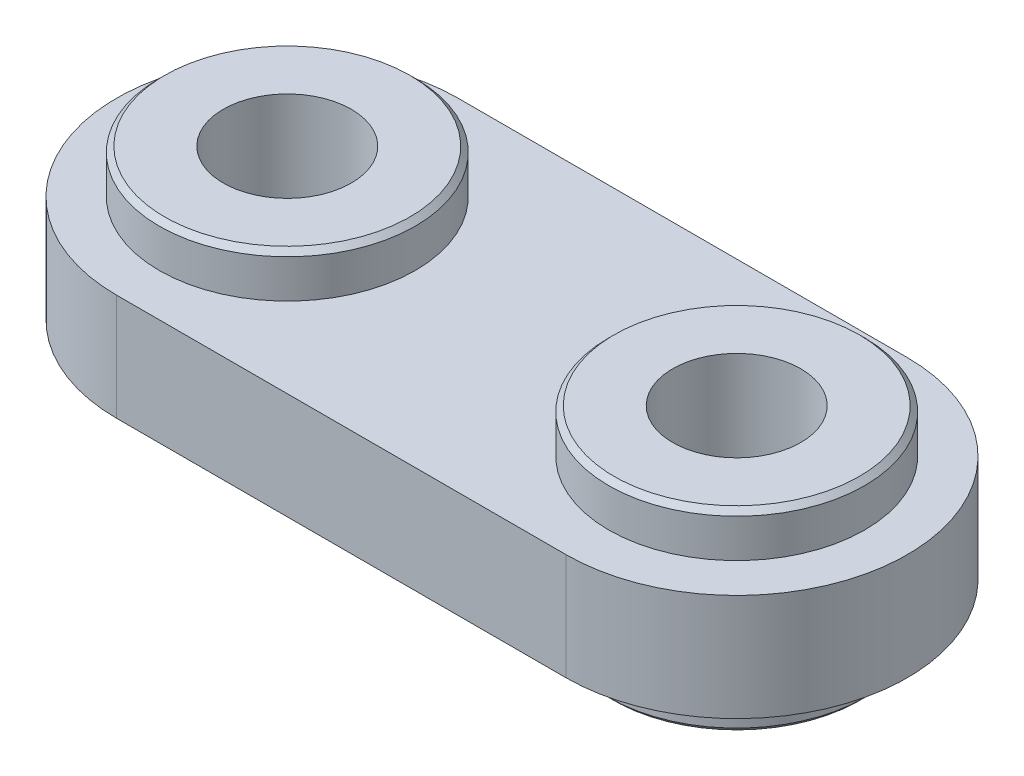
ISO-10303-21;
HEADER;
FILE_DESCRIPTION(('STEP AP214'),'2;1');
FILE_NAME('part.step','',(''),(''),'','','');
FILE_SCHEMA(('AUTOMOTIVE_DESIGN { 1 0 10303 214 1 1 1 1 }'));
ENDSEC;
DATA;
#1=APPLICATION_CONTEXT('core data for automotive mechanical design processes');
#2=APPLICATION_PROTOCOL_DEFINITION('international standard','automotive_design',2000,#1);
#3=PRODUCT_CONTEXT('',#1,'mechanical');
#4=PRODUCT('Part','Part','',(#3));
#5=PRODUCT_RELATED_PRODUCT_CATEGORY('part','',(#4));
#6=PRODUCT_DEFINITION_FORMATION('','',#4);
#7=PRODUCT_DEFINITION_CONTEXT('part definition',#1,'design');
#8=PRODUCT_DEFINITION('design','',#6,#7);
#9=PRODUCT_DEFINITION_SHAPE('','',#8);
#10=(LENGTH_UNIT() NAMED_UNIT(*) SI_UNIT(.MILLI.,.METRE.));
#11=(NAMED_UNIT(*) PLANE_ANGLE_UNIT() SI_UNIT($,.RADIAN.));
#12=(NAMED_UNIT(*) SI_UNIT($,.STERADIAN.) SOLID_ANGLE_UNIT());
#13=UNCERTAINTY_MEASURE_WITH_UNIT(LENGTH_MEASURE(1.E-05),#10,'distance_accuracy_value','');
#14=(GEOMETRIC_REPRESENTATION_CONTEXT(3) GLOBAL_UNCERTAINTY_ASSIGNED_CONTEXT((#13)) GLOBAL_UNIT_ASSIGNED_CONTEXT((#10,
#11,#12)) REPRESENTATION_CONTEXT('',''));
#15=CARTESIAN_POINT('',(0.,0.,0.));
#16=DIRECTION('',(0.,0.,1.));
#17=DIRECTION('',(1.,0.,0.));
#18=AXIS2_PLACEMENT_3D('',#15,#16,#17);
#19=CARTESIAN_POINT('',(0.,0.,0.));
#20=DIRECTION('',(0.,-1.,0.));
#21=DIRECTION('',(-1.,0.,0.));
#22=AXIS2_PLACEMENT_3D('',#19,#20,#21);
#23=CYLINDRICAL_SURFACE('',#22,8.);
#24=CARTESIAN_POINT('',(0.,-2.5,0.));
#25=DIRECTION('',(0.,1.,0.));
#26=DIRECTION('',(1.,0.,0.));
#27=AXIS2_PLACEMENT_3D('',#24,#25,#26);
#28=CIRCLE('',#27,8.);
#29=CARTESIAN_POINT('',(0.,-2.5,-8.));
#30=VERTEX_POINT('',#29);
#31=CARTESIAN_POINT('',(0.,-2.5,8.));
#32=VERTEX_POINT('',#31);
#33=EDGE_CURVE('E59',#30,#32,#28,.T.);
#34=ORIENTED_EDGE('',*,*,#33,.T.);
#35=DIRECTION('',(0.,-1.,0.));
#36=VECTOR('',#35,1.);
#37=CARTESIAN_POINT('',(0.,0.,8.));
#38=LINE('',#37,#36);
#39=CARTESIAN_POINT('',(0.,2.5,8.));
#40=VERTEX_POINT('',#39);
#41=EDGE_CURVE('E64',#40,#32,#38,.T.);
#42=ORIENTED_EDGE('',*,*,#41,.F.);
#43=CARTESIAN_POINT('',(0.,2.5,0.));
#44=DIRECTION('',(0.,1.,0.));
#45=DIRECTION('',(1.,0.,0.));
#46=AXIS2_PLACEMENT_3D('',#43,#44,#45);
#47=CIRCLE('',#46,8.);
#48=CARTESIAN_POINT('',(0.,2.5,-8.));
#49=VERTEX_POINT('',#48);
#50=EDGE_CURVE('E91',#49,#40,#47,.T.);
#51=ORIENTED_EDGE('',*,*,#50,.F.);
#52=DIRECTION('',(0.,-1.,0.));
#53=VECTOR('',#52,1.);
#54=CARTESIAN_POINT('',(0.,0.,-8.));
#55=LINE('',#54,#53);
#56=EDGE_CURVE('E66',#49,#30,#55,.T.);
#57=ORIENTED_EDGE('',*,*,#56,.T.);
#58=EDGE_LOOP('',(#34,#42,#51,#57));
#59=FACE_BOUND('',#58,.T.);
#60=ADVANCED_FACE('F14',(#59),#23,.T.);
#61=CARTESIAN_POINT('',(0.,0.,8.));
#62=DIRECTION('',(0.,0.,-1.));
#63=DIRECTION('',(0.,1.,0.));
#64=AXIS2_PLACEMENT_3D('',#61,#62,#63);
#65=PLANE('',#64);
#66=DIRECTION('',(1.,0.,0.));
#67=VECTOR('',#66,1.);
#68=CARTESIAN_POINT('',(0.,-2.5,8.));
#69=LINE('',#68,#67);
#70=CARTESIAN_POINT('',(21.068,-2.5,8.));
#71=VERTEX_POINT('',#70);
#72=EDGE_CURVE('E69',#32,#71,#69,.T.);
#73=ORIENTED_EDGE('',*,*,#72,.T.);
#74=DIRECTION('',(0.,-1.,0.));
#75=VECTOR('',#74,1.);
#76=CARTESIAN_POINT('',(21.068,0.,8.));
#77=LINE('',#76,#75);
#78=CARTESIAN_POINT('',(21.068,2.5,8.));
#79=VERTEX_POINT('',#78);
#80=EDGE_CURVE('E47',#79,#71,#77,.T.);
#81=ORIENTED_EDGE('',*,*,#80,.F.);
#82=DIRECTION('',(1.,0.,0.));
#83=VECTOR('',#82,1.);
#84=CARTESIAN_POINT('',(0.,2.5,8.));
#85=LINE('',#84,#83);
#86=EDGE_CURVE('E73',#40,#79,#85,.T.);
#87=ORIENTED_EDGE('',*,*,#86,.F.);
#88=ORIENTED_EDGE('',*,*,#41,.T.);
#89=EDGE_LOOP('',(#73,#81,#87,#88));
#90=FACE_BOUND('',#89,.T.);
#91=ADVANCED_FACE('F72',(#90),#65,.F.);
#92=CARTESIAN_POINT('',(21.068,0.,0.));
#93=DIRECTION('',(0.,-1.,0.));
#94=DIRECTION('',(-1.,0.,0.));
#95=AXIS2_PLACEMENT_3D('',#92,#93,#94);
#96=CYLINDRICAL_SURFACE('',#95,8.);
#97=CARTESIAN_POINT('',(21.068,-2.5,0.));
#98=DIRECTION('',(0.,1.,0.));
#99=DIRECTION('',(-1.,0.,0.));
#100=AXIS2_PLACEMENT_3D('',#97,#98,#99);
#101=CIRCLE('',#100,8.);
#102=CARTESIAN_POINT('',(21.068,-2.5,-8.));
#103=VERTEX_POINT('',#102);
#104=EDGE_CURVE('E31',#71,#103,#101,.T.);
#105=ORIENTED_EDGE('',*,*,#104,.T.);
#106=DIRECTION('',(0.,-1.,0.));
#107=VECTOR('',#106,1.);
#108=CARTESIAN_POINT('',(21.068,0.,-8.));
#109=LINE('',#108,#107);
#110=CARTESIAN_POINT('',(21.068,2.5,-8.));
#111=VERTEX_POINT('',#110);
#112=EDGE_CURVE('E51',#111,#103,#109,.T.);
#113=ORIENTED_EDGE('',*,*,#112,.F.);
#114=CARTESIAN_POINT('',(21.068,2.5,0.));
#115=DIRECTION('',(0.,1.,0.));
#116=DIRECTION('',(-1.,0.,0.));
#117=AXIS2_PLACEMENT_3D('',#114,#115,#116);
#118=CIRCLE('',#117,8.);
#119=EDGE_CURVE('E86',#79,#111,#118,.T.);
#120=ORIENTED_EDGE('',*,*,#119,.F.);
#121=ORIENTED_EDGE('',*,*,#80,.T.);
#122=EDGE_LOOP('',(#105,#113,#120,#121));
#123=FACE_BOUND('',#122,.T.);
#124=ADVANCED_FACE('F148',(#123),#96,.T.);
#125=CARTESIAN_POINT('',(21.068,0.,-8.));
#126=DIRECTION('',(0.,0.,1.));
#127=DIRECTION('',(0.,-1.,0.));
#128=AXIS2_PLACEMENT_3D('',#125,#126,#127);
#129=PLANE('',#128);
#130=DIRECTION('',(-1.,0.,0.));
#131=VECTOR('',#130,1.);
#132=CARTESIAN_POINT('',(21.068,-2.5,-8.));
#133=LINE('',#132,#131);
#134=EDGE_CURVE('E70',#103,#30,#133,.T.);
#135=ORIENTED_EDGE('',*,*,#134,.T.);
#136=ORIENTED_EDGE('',*,*,#56,.F.);
#137=DIRECTION('',(-1.,0.,0.));
#138=VECTOR('',#137,1.);
#139=CARTESIAN_POINT('',(21.068,2.5,-8.));
#140=LINE('',#139,#138);
#141=EDGE_CURVE('E93',#111,#49,#140,.T.);
#142=ORIENTED_EDGE('',*,*,#141,.F.);
#143=ORIENTED_EDGE('',*,*,#112,.T.);
#144=EDGE_LOOP('',(#135,#136,#142,#143));
#145=FACE_BOUND('',#144,.T.);
#146=ADVANCED_FACE('F152',(#145),#129,.F.);
#147=CARTESIAN_POINT('',(0.,-2.5,0.));
#148=DIRECTION('',(0.,1.,0.));
#149=DIRECTION('',(1.,0.,0.));
#150=AXIS2_PLACEMENT_3D('',#147,#148,#149);
#151=PLANE('',#150);
#152=CARTESIAN_POINT('',(21.0679999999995,-2.5,0.));
#153=DIRECTION('',(0.,1.,0.));
#154=DIRECTION('',(0.,0.,1.));
#155=AXIS2_PLACEMENT_3D('',#152,#153,#154);
#156=CIRCLE('',#155,6.);
#157=CARTESIAN_POINT('',(21.0679999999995,-2.5,6.00000000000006));
#158=VERTEX_POINT('',#157);
#159=EDGE_CURVE('E229',#158,#158,#156,.T.);
#160=ORIENTED_EDGE('',*,*,#159,.T.);
#161=EDGE_LOOP('',(#160));
#162=FACE_BOUND('',#161,.T.);
#163=CARTESIAN_POINT('',(0.,-2.5,0.));
#164=DIRECTION('',(0.,1.,0.));
#165=DIRECTION('',(0.,0.,1.));
#166=AXIS2_PLACEMENT_3D('',#163,#164,#165);
#167=CIRCLE('',#166,6.);
#168=CARTESIAN_POINT('',(0.,-2.5,6.));
#169=VERTEX_POINT('',#168);
#170=EDGE_CURVE('E102',#169,#169,#167,.T.);
#171=ORIENTED_EDGE('',*,*,#170,.T.);
#172=EDGE_LOOP('',(#171));
#173=FACE_BOUND('',#172,.T.);
#174=ORIENTED_EDGE('',*,*,#134,.F.);
#175=ORIENTED_EDGE('',*,*,#104,.F.);
#176=ORIENTED_EDGE('',*,*,#72,.F.);
#177=ORIENTED_EDGE('',*,*,#33,.F.);
#178=EDGE_LOOP('',(#174,#175,#176,#177));
#179=FACE_BOUND('',#178,.T.);
#180=ADVANCED_FACE('F75',(#162,#173,#179),#151,.F.);
#181=CARTESIAN_POINT('',(0.,2.5,0.));
#182=DIRECTION('',(0.,1.,0.));
#183=DIRECTION('',(1.,0.,0.));
#184=AXIS2_PLACEMENT_3D('',#181,#182,#183);
#185=PLANE('',#184);
#186=CARTESIAN_POINT('',(21.0679999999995,2.5,0.));
#187=DIRECTION('',(0.,1.,0.));
#188=DIRECTION('',(0.,0.,1.));
#189=AXIS2_PLACEMENT_3D('',#186,#187,#188);
#190=CIRCLE('',#189,6.);
#191=CARTESIAN_POINT('',(21.0679999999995,2.5,6.00000000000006));
#192=VERTEX_POINT('',#191);
#193=EDGE_CURVE('E105',#192,#192,#190,.T.);
#194=ORIENTED_EDGE('',*,*,#193,.F.);
#195=EDGE_LOOP('',(#194));
#196=FACE_BOUND('',#195,.T.);
#197=CARTESIAN_POINT('',(0.,2.5,0.));
#198=DIRECTION('',(0.,1.,0.));
#199=DIRECTION('',(0.,0.,1.));
#200=AXIS2_PLACEMENT_3D('',#197,#198,#199);
#201=CIRCLE('',#200,6.);
#202=CARTESIAN_POINT('',(0.,2.5,6.));
#203=VERTEX_POINT('',#202);
#204=EDGE_CURVE('E90',#203,#203,#201,.T.);
#205=ORIENTED_EDGE('',*,*,#204,.F.);
#206=EDGE_LOOP('',(#205));
#207=FACE_BOUND('',#206,.T.);
#208=ORIENTED_EDGE('',*,*,#141,.T.);
#209=ORIENTED_EDGE('',*,*,#50,.T.);
#210=ORIENTED_EDGE('',*,*,#86,.T.);
#211=ORIENTED_EDGE('',*,*,#119,.T.);
#212=EDGE_LOOP('',(#208,#209,#210,#211));
#213=FACE_BOUND('',#212,.T.);
#214=ADVANCED_FACE('F156',(#196,#207,#213),#185,.T.);
#215=CARTESIAN_POINT('',(0.,-4.6,0.));
#216=DIRECTION('',(0.,1.,0.));
#217=DIRECTION('',(-1.,0.,0.));
#218=AXIS2_PLACEMENT_3D('',#215,#216,#217);
#219=CYLINDRICAL_SURFACE('',#218,6.);
#220=CARTESIAN_POINT('',(0.,4.3,0.));
#221=DIRECTION('',(0.,-1.,0.));
#222=DIRECTION('',(0.,0.,-1.));
#223=AXIS2_PLACEMENT_3D('',#220,#221,#222);
#224=CIRCLE('',#223,6.);
#225=CARTESIAN_POINT('',(0.,4.3,-6.));
#226=VERTEX_POINT('',#225);
#227=EDGE_CURVE('E108',#226,#226,#224,.T.);
#228=ORIENTED_EDGE('',*,*,#227,.T.);
#229=EDGE_LOOP('',(#228));
#230=FACE_BOUND('',#229,.T.);
#231=ORIENTED_EDGE('',*,*,#204,.T.);
#232=EDGE_LOOP('',(#231));
#233=FACE_BOUND('',#232,.T.);
#234=ADVANCED_FACE('F159',(#230,#233),#219,.T.);
#235=CARTESIAN_POINT('',(0.,4.55,0.));
#236=DIRECTION('',(0.,-1.,0.));
#237=DIRECTION('',(0.,0.,-1.));
#238=AXIS2_PLACEMENT_3D('',#235,#236,#237);
#239=PLANE('',#238);
#240=CARTESIAN_POINT('',(0.,4.55,0.));
#241=DIRECTION('',(0.,-1.,0.));
#242=DIRECTION('',(0.,0.,-1.));
#243=AXIS2_PLACEMENT_3D('',#240,#241,#242);
#244=CIRCLE('',#243,5.75);
#245=CARTESIAN_POINT('',(0.,4.55,-5.75));
#246=VERTEX_POINT('',#245);
#247=EDGE_CURVE('E111',#246,#246,#244,.F.);
#248=ORIENTED_EDGE('',*,*,#247,.T.);
#249=EDGE_LOOP('',(#248));
#250=FACE_BOUND('',#249,.T.);
#251=CARTESIAN_POINT('',(0.,4.55,0.));
#252=DIRECTION('',(0.,-1.,0.));
#253=DIRECTION('',(0.,0.,-1.));
#254=AXIS2_PLACEMENT_3D('',#251,#252,#253);
#255=CIRCLE('',#254,3.);
#256=CARTESIAN_POINT('',(0.,4.55,-3.));
#257=VERTEX_POINT('',#256);
#258=EDGE_CURVE('E232',#257,#257,#255,.T.);
#259=ORIENTED_EDGE('',*,*,#258,.T.);
#260=EDGE_LOOP('',(#259));
#261=FACE_BOUND('',#260,.T.);
#262=ADVANCED_FACE('F163',(#250,#261),#239,.F.);
#263=CARTESIAN_POINT('',(0.,-4.6,0.));
#264=DIRECTION('',(0.,1.,0.));
#265=DIRECTION('',(-1.,0.,0.));
#266=AXIS2_PLACEMENT_3D('',#263,#264,#265);
#267=CYLINDRICAL_SURFACE('',#266,3.);
#268=CARTESIAN_POINT('',(0.,-4.55,0.));
#269=DIRECTION('',(0.,-1.,0.));
#270=DIRECTION('',(0.,0.,-1.));
#271=AXIS2_PLACEMENT_3D('',#268,#269,#270);
#272=CIRCLE('',#271,3.);
#273=CARTESIAN_POINT('',(0.,-4.55,-3.));
#274=VERTEX_POINT('',#273);
#275=EDGE_CURVE('E98',#274,#274,#272,.F.);
#276=ORIENTED_EDGE('',*,*,#275,.F.);
#277=EDGE_LOOP('',(#276));
#278=FACE_BOUND('',#277,.T.);
#279=ORIENTED_EDGE('',*,*,#258,.F.);
#280=EDGE_LOOP('',(#279));
#281=FACE_BOUND('',#280,.T.);
#282=ADVANCED_FACE('F165',(#278,#281),#267,.F.);
#283=CARTESIAN_POINT('',(0.,-4.55,0.));
#284=DIRECTION('',(0.,-1.,0.));
#285=DIRECTION('',(0.,0.,-1.));
#286=AXIS2_PLACEMENT_3D('',#283,#284,#285);
#287=PLANE('',#286);
#288=CARTESIAN_POINT('',(0.,-4.55,0.));
#289=DIRECTION('',(0.,-1.,0.));
#290=DIRECTION('',(0.,0.,-1.));
#291=AXIS2_PLACEMENT_3D('',#288,#289,#290);
#292=CIRCLE('',#291,5.75);
#293=CARTESIAN_POINT('',(0.,-4.55,-5.75));
#294=VERTEX_POINT('',#293);
#295=EDGE_CURVE('E23',#294,#294,#292,.T.);
#296=ORIENTED_EDGE('',*,*,#295,.T.);
#297=EDGE_LOOP('',(#296));
#298=FACE_BOUND('',#297,.T.);
#299=ORIENTED_EDGE('',*,*,#275,.T.);
#300=EDGE_LOOP('',(#299));
#301=FACE_BOUND('',#300,.T.);
#302=ADVANCED_FACE('F128',(#298,#301),#287,.T.);
#303=CARTESIAN_POINT('',(0.,-2.5,0.));
#304=DIRECTION('',(0.,-1.,0.));
#305=DIRECTION('',(1.,0.,0.));
#306=AXIS2_PLACEMENT_3D('',#303,#304,#305);
#307=CYLINDRICAL_SURFACE('',#306,6.);
#308=CARTESIAN_POINT('',(0.,-4.3,0.));
#309=DIRECTION('',(0.,-1.,0.));
#310=DIRECTION('',(0.,0.,-1.));
#311=AXIS2_PLACEMENT_3D('',#308,#309,#310);
#312=CIRCLE('',#311,6.);
#313=CARTESIAN_POINT('',(0.,-4.3,-6.));
#314=VERTEX_POINT('',#313);
#315=EDGE_CURVE('E9',#314,#314,#312,.F.);
#316=ORIENTED_EDGE('',*,*,#315,.T.);
#317=EDGE_LOOP('',(#316));
#318=FACE_BOUND('',#317,.T.);
#319=ORIENTED_EDGE('',*,*,#170,.F.);
#320=EDGE_LOOP('',(#319));
#321=FACE_BOUND('',#320,.T.);
#322=ADVANCED_FACE('F173',(#318,#321),#307,.T.);
#323=CARTESIAN_POINT('',(21.0679999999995,-4.6,0.));
#324=DIRECTION('',(0.,1.,0.));
#325=DIRECTION('',(-1.,0.,0.));
#326=AXIS2_PLACEMENT_3D('',#323,#324,#325);
#327=CYLINDRICAL_SURFACE('',#326,6.);
#328=CARTESIAN_POINT('',(21.0679999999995,4.3,0.));
#329=DIRECTION('',(0.,-1.,0.));
#330=DIRECTION('',(0.,0.,-1.));
#331=AXIS2_PLACEMENT_3D('',#328,#329,#330);
#332=CIRCLE('',#331,6.);
#333=CARTESIAN_POINT('',(21.0679999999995,4.3,-5.99999999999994));
#334=VERTEX_POINT('',#333);
#335=EDGE_CURVE('E114',#334,#334,#332,.T.);
#336=ORIENTED_EDGE('',*,*,#335,.T.);
#337=EDGE_LOOP('',(#336));
#338=FACE_BOUND('',#337,.T.);
#339=ORIENTED_EDGE('',*,*,#193,.T.);
#340=EDGE_LOOP('',(#339));
#341=FACE_BOUND('',#340,.T.);
#342=ADVANCED_FACE('F169',(#338,#341),#327,.T.);
#343=CARTESIAN_POINT('',(21.0679999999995,4.55,0.));
#344=DIRECTION('',(0.,-1.,0.));
#345=DIRECTION('',(0.,0.,-1.));
#346=AXIS2_PLACEMENT_3D('',#343,#344,#345);
#347=PLANE('',#346);
#348=CARTESIAN_POINT('',(21.0679999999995,4.55,0.));
#349=DIRECTION('',(0.,-1.,0.));
#350=DIRECTION('',(0.,0.,-1.));
#351=AXIS2_PLACEMENT_3D('',#348,#349,#350);
#352=CIRCLE('',#351,5.75);
#353=CARTESIAN_POINT('',(21.0679999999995,4.55,-5.74999999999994));
#354=VERTEX_POINT('',#353);
#355=EDGE_CURVE('E117',#354,#354,#352,.F.);
#356=ORIENTED_EDGE('',*,*,#355,.T.);
#357=EDGE_LOOP('',(#356));
#358=FACE_BOUND('',#357,.T.);
#359=CARTESIAN_POINT('',(21.0679999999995,4.55,0.));
#360=DIRECTION('',(0.,-1.,0.));
#361=DIRECTION('',(0.,0.,-1.));
#362=AXIS2_PLACEMENT_3D('',#359,#360,#361);
#363=CIRCLE('',#362,3.);
#364=CARTESIAN_POINT('',(21.0679999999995,4.55,-2.99999999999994));
#365=VERTEX_POINT('',#364);
#366=EDGE_CURVE('E227',#365,#365,#363,.T.);
#367=ORIENTED_EDGE('',*,*,#366,.T.);
#368=EDGE_LOOP('',(#367));
#369=FACE_BOUND('',#368,.T.);
#370=ADVANCED_FACE('F172',(#358,#369),#347,.F.);
#371=CARTESIAN_POINT('',(21.0679999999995,-4.6,0.));
#372=DIRECTION('',(0.,1.,0.));
#373=DIRECTION('',(-1.,0.,0.));
#374=AXIS2_PLACEMENT_3D('',#371,#372,#373);
#375=CYLINDRICAL_SURFACE('',#374,3.);
#376=CARTESIAN_POINT('',(21.0679999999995,-4.55,0.));
#377=DIRECTION('',(0.,-1.,0.));
#378=DIRECTION('',(0.,0.,-1.));
#379=AXIS2_PLACEMENT_3D('',#376,#377,#378);
#380=CIRCLE('',#379,3.);
#381=CARTESIAN_POINT('',(21.0679999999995,-4.55,-2.99999999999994));
#382=VERTEX_POINT('',#381);
#383=EDGE_CURVE('E99',#382,#382,#380,.F.);
#384=ORIENTED_EDGE('',*,*,#383,.F.);
#385=EDGE_LOOP('',(#384));
#386=FACE_BOUND('',#385,.T.);
#387=ORIENTED_EDGE('',*,*,#366,.F.);
#388=EDGE_LOOP('',(#387));
#389=FACE_BOUND('',#388,.T.);
#390=ADVANCED_FACE('F175',(#386,#389),#375,.F.);
#391=CARTESIAN_POINT('',(21.0679999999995,-4.55,0.));
#392=DIRECTION('',(0.,-1.,0.));
#393=DIRECTION('',(0.,0.,-1.));
#394=AXIS2_PLACEMENT_3D('',#391,#392,#393);
#395=CIRCLE('',#394,5.75);
#396=CARTESIAN_POINT('',(21.0679999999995,-4.55,-5.74999999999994));
#397=VERTEX_POINT('',#396);
#398=EDGE_CURVE('E120',#397,#397,#395,.T.);
#399=ORIENTED_EDGE('',*,*,#398,.T.);
#400=EDGE_LOOP('',(#399));
#401=FACE_BOUND('',#400,.T.);
#402=ORIENTED_EDGE('',*,*,#383,.T.);
#403=EDGE_LOOP('',(#402));
#404=FACE_BOUND('',#403,.T.);
#405=ADVANCED_FACE('F178',(#401,#404),#287,.T.);
#406=CARTESIAN_POINT('',(21.0679999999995,-2.5,0.));
#407=DIRECTION('',(0.,-1.,0.));
#408=DIRECTION('',(1.,0.,0.));
#409=AXIS2_PLACEMENT_3D('',#406,#407,#408);
#410=CYLINDRICAL_SURFACE('',#409,6.);
#411=CARTESIAN_POINT('',(21.0679999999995,-4.3,0.));
#412=DIRECTION('',(0.,-1.,0.));
#413=DIRECTION('',(0.,0.,-1.));
#414=AXIS2_PLACEMENT_3D('',#411,#412,#413);
#415=CIRCLE('',#414,6.);
#416=CARTESIAN_POINT('',(21.0679999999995,-4.3,-5.99999999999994));
#417=VERTEX_POINT('',#416);
#418=EDGE_CURVE('E123',#417,#417,#415,.F.);
#419=ORIENTED_EDGE('',*,*,#418,.T.);
#420=EDGE_LOOP('',(#419));
#421=FACE_BOUND('',#420,.T.);
#422=ORIENTED_EDGE('',*,*,#159,.F.);
#423=EDGE_LOOP('',(#422));
#424=FACE_BOUND('',#423,.T.);
#425=ADVANCED_FACE('F183',(#421,#424),#410,.T.);
#426=CARTESIAN_POINT('',(0.,4.3,0.));
#427=DIRECTION('',(0.,-1.,0.));
#428=DIRECTION('',(0.,0.,-1.));
#429=AXIS2_PLACEMENT_3D('',#426,#427,#428);
#430=CONICAL_SURFACE('',#429,6.,0.785398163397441);
#431=ORIENTED_EDGE('',*,*,#247,.F.);
#432=EDGE_LOOP('',(#431));
#433=FACE_BOUND('',#432,.T.);
#434=ORIENTED_EDGE('',*,*,#227,.F.);
#435=EDGE_LOOP('',(#434));
#436=FACE_BOUND('',#435,.T.);
#437=ADVANCED_FACE('F186',(#433,#436),#430,.T.);
#438=CARTESIAN_POINT('',(21.0679999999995,4.3,0.));
#439=DIRECTION('',(0.,-1.,0.));
#440=DIRECTION('',(0.,0.,-1.));
#441=AXIS2_PLACEMENT_3D('',#438,#439,#440);
#442=CONICAL_SURFACE('',#441,6.,0.785398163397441);
#443=ORIENTED_EDGE('',*,*,#355,.F.);
#444=EDGE_LOOP('',(#443));
#445=FACE_BOUND('',#444,.T.);
#446=ORIENTED_EDGE('',*,*,#335,.F.);
#447=EDGE_LOOP('',(#446));
#448=FACE_BOUND('',#447,.T.);
#449=ADVANCED_FACE('F139',(#445,#448),#442,.T.);
#450=CARTESIAN_POINT('',(21.0679999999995,-4.55,0.));
#451=DIRECTION('',(0.,1.,0.));
#452=DIRECTION('',(0.,0.,1.));
#453=AXIS2_PLACEMENT_3D('',#450,#451,#452);
#454=CONICAL_SURFACE('',#453,5.75,0.785398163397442);
#455=ORIENTED_EDGE('',*,*,#418,.F.);
#456=EDGE_LOOP('',(#455));
#457=FACE_BOUND('',#456,.T.);
#458=ORIENTED_EDGE('',*,*,#398,.F.);
#459=EDGE_LOOP('',(#458));
#460=FACE_BOUND('',#459,.T.);
#461=ADVANCED_FACE('F132',(#457,#460),#454,.T.);
#462=CARTESIAN_POINT('',(0.,-4.55,0.));
#463=DIRECTION('',(0.,1.,0.));
#464=DIRECTION('',(0.,0.,1.));
#465=AXIS2_PLACEMENT_3D('',#462,#463,#464);
#466=CONICAL_SURFACE('',#465,5.75,0.785398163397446);
#467=ORIENTED_EDGE('',*,*,#315,.F.);
#468=EDGE_LOOP('',(#467));
#469=FACE_BOUND('',#468,.T.);
#470=ORIENTED_EDGE('',*,*,#295,.F.);
#471=EDGE_LOOP('',(#470));
#472=FACE_BOUND('',#471,.T.);
#473=ADVANCED_FACE('F16',(#469,#472),#466,.T.);
#474=CLOSED_SHELL('',(#60,#91,#124,#146,#180,#214,#234,#262,#282,#302,#322,#342,#370,#390,#405,
#425,#437,#449,#461,#473));
#475=MANIFOLD_SOLID_BREP('B1',#474);
#476=ADVANCED_BREP_SHAPE_REPRESENTATION('',(#18,#475),#14);
#477=SHAPE_DEFINITION_REPRESENTATION(#9,#476);
ENDSEC;
END-ISO-10303-21;
